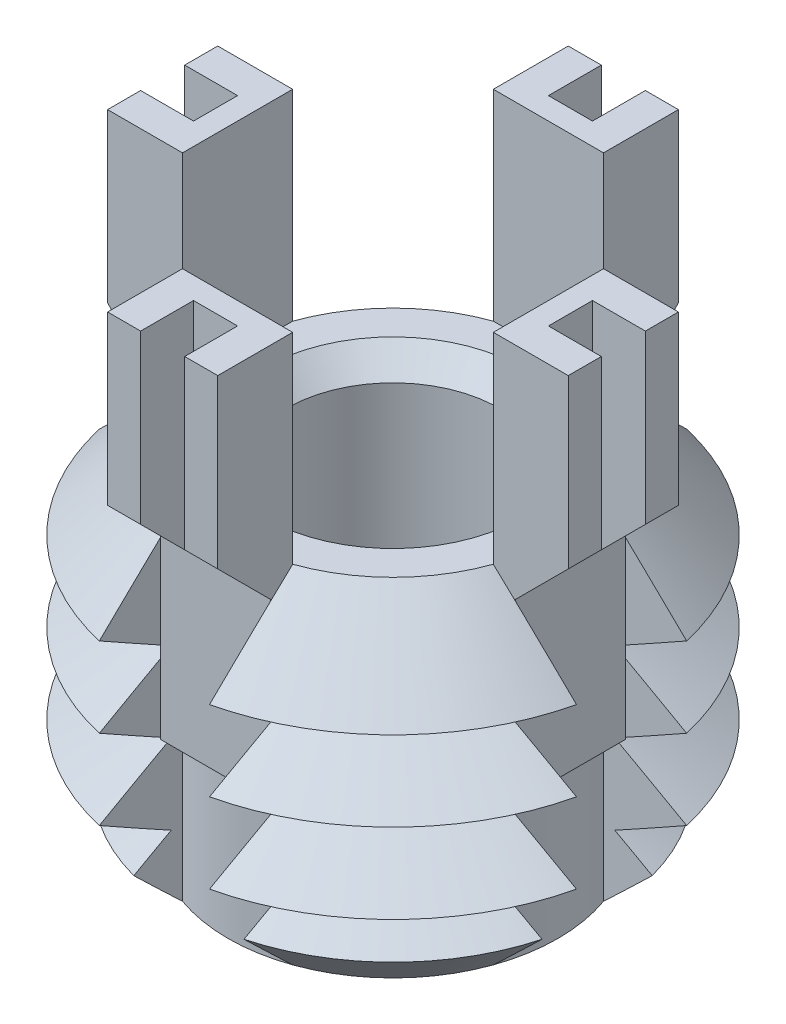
from build123d import *

# Parameters (mm, degrees)
SKETCH1_R               = 5.556
BOSS_EXTRUDE1_DEPTH     = 7.874
CHAMFER1_SIZE           = 1.814
LPATTERN1_COUNT         = 3
LPATTERN1_PITCH         = 1.814
CUT_EXTRUDE1_REACH      = 13.124
CIRPATTERN1_COUNT       = 4
BOSS_EXTRUDE3_DEPTH     = 1.25
CIRPATTERN2_COUNT       = 4
CUT_EXTRUDE3_DEPTH      = 15.600270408
CUT_EXTRUDE3_DEPTH_BACK = 15.600270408
SKETCH6_W               = 1.2
SKETCH6_H               = 1
SKETCH6_W_2             = 1
SKETCH6_H_2             = 1.2
SKETCH7_R               = 2.413
CUT_EXTRUDE4_DEPTH      = 7.874
CHAMFER2_SIZE           = 0.529


with BuildPart() as part:
    # Sketch1 → Boss-Extrude1 (new body)
    with BuildSketch(Plane(origin=(0, 0, 0), x_dir=(1, 0, 0), z_dir=(0, 1, 0))):
        with Locations(Location((0, 0, 0), (0, 0, 270))):
            Circle(SKETCH1_R)
    extrude(amount=-BOSS_EXTRUDE1_DEPTH)

    # Chamfer1
    chamfer1_edges = [part.edges().sort_by_distance(p)[0] for p in [
        (0, 0, -5.556),
        (0, -7.874, -5.556),
    ]]
    chamfer(chamfer1_edges, length=CHAMFER1_SIZE)

    # Sketch3 → Cut-Revolve1 (revolve, cut)
    with BuildSketch(Plane(origin=(0, 0, 0), x_dir=(0, 0, -1), z_dir=(1, 0, 0))):
        Polygon((-5.556, -1.814), (-3.985029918, -2.721), (-5.556, -3.628), align=None)
    cut_revolve1 = revolve(axis=Axis((0, 0.885892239, 0), (0, -1, 0)), mode=Mode.SUBTRACT)

    # LPattern1: Cut-Revolve1 ×3
    with Locations(*[(0, -i * LPATTERN1_PITCH, 0) for i in range(1, LPATTERN1_COUNT)]):
        add(cut_revolve1, mode=Mode.SUBTRACT)

    # Cut-Extrude1: up to this cone (the profile starts inside it)
    cut_extrude1_end = Plane(origin=(0, 0, 0), z_dir=(0, 1, 0)).offset(-11.615999) * Cone(1e-06, 36.856, 36.855999, align=(Align.CENTER, Align.CENTER, Align.MIN), mode=Mode.PRIVATE)
    # Sketch4 → Cut-Extrude1 (cut, up to the surface)
    with BuildSketch(Plane(origin=(0, 0, 0), x_dir=(1, 0, 0), z_dir=(0, 1, 0)), mode=Mode.PRIVATE) as cut_extrude1_sk1:
        with BuildLine():
            Line((-3.52704749, 1.25), (-5.413560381, 1.25))
            ThreePointArc((-5.413560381, 1.25), (-5.556, 0), (-5.413560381, -1.25))
            Line((-5.413560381, -1.25), (-3.52704749, -1.25))
            ThreePointArc((-3.52704749, -1.25), (-3.742, 0), (-3.52704749, 1.25))
        make_face()
    cut_extrude1_tool1 = extrude(cut_extrude1_sk1.sketch, amount=-CUT_EXTRUDE1_REACH, mode=Mode.PRIVATE) & cut_extrude1_end
    cut_extrude1 = cut_extrude1_tool1.solids().sort_by_distance((-4.589361, 0, 0))[0]
    add(cut_extrude1, mode=Mode.SUBTRACT)

    # CirPattern1: Cut-Extrude1 ×4 about axis
    cirpattern1_axis = Axis((0, 0, 0), (0, 1, 0))
    for i in range(1, CIRPATTERN1_COUNT):
        add(cut_extrude1.rotate(cirpattern1_axis, i * 360 / CIRPATTERN1_COUNT), mode=Mode.SUBTRACT)

    # Sketch5 → Boss-Extrude3 (add, symmetric)
    with BuildSketch(Plane(origin=(0, 0, 0), x_dir=(0, 0, -1), z_dir=(1, 0, 0))):
        Polygon((-3.52704749, 4.558), (-3.52704749, -4.442), (-4.02704749, -4.442), (-4.02704749, -0.442), (-5.22704749, 0.758), (-5.22704749, 4.558), align=None)
    boss_extrude3 = extrude(amount=BOSS_EXTRUDE3_DEPTH, both=True)

    # CirPattern2: Boss-Extrude3 ×4 about axis
    cirpattern2_axis = Axis((0, 0, 0), (0, 1, 0))
    for i in range(1, CIRPATTERN2_COUNT):
        add(boss_extrude3.rotate(cirpattern2_axis, i * 360 / CIRPATTERN2_COUNT))

    # Sketch6 → Cut-Extrude3 (cut, two sides: drawn at the far end of the back side and taken through both)
    with BuildSketch(Plane(origin=(0, 4.558, 0), x_dir=(1, 0, 0), z_dir=(0, 1, 0)).offset(-CUT_EXTRUDE3_DEPTH_BACK)):
        with Locations((-4.62704749, 0)):
            Rectangle(SKETCH6_W, SKETCH6_H)
        with Locations((0, 4.62704749)):
            Rectangle(SKETCH6_W_2, SKETCH6_H_2)
        with Locations((4.62704749, 0)):
            Rectangle(SKETCH6_W, SKETCH6_H)
        with Locations((0, -4.62704749)):
            Rectangle(SKETCH6_W_2, SKETCH6_H_2)
    extrude(amount=CUT_EXTRUDE3_DEPTH + CUT_EXTRUDE3_DEPTH_BACK, mode=Mode.SUBTRACT)

    # Sketch7 → Cut-Extrude4 (cut)
    with BuildSketch(Plane(origin=(0, 0, 0), x_dir=(1, 0, 0), z_dir=(0, 1, 0))):
        with Locations(Location((0, 0, 0), (0, 0, 270))):
            Circle(SKETCH7_R)
    extrude(amount=-CUT_EXTRUDE4_DEPTH, mode=Mode.SUBTRACT)

    # Chamfer2
    chamfer2_edges = [part.edges().sort_by_distance(p)[0] for p in [
        (0, 0, -2.413),
        (0, -7.874, -2.413),
    ]]
    chamfer(chamfer2_edges, length=CHAMFER2_SIZE)


solid = part.part
